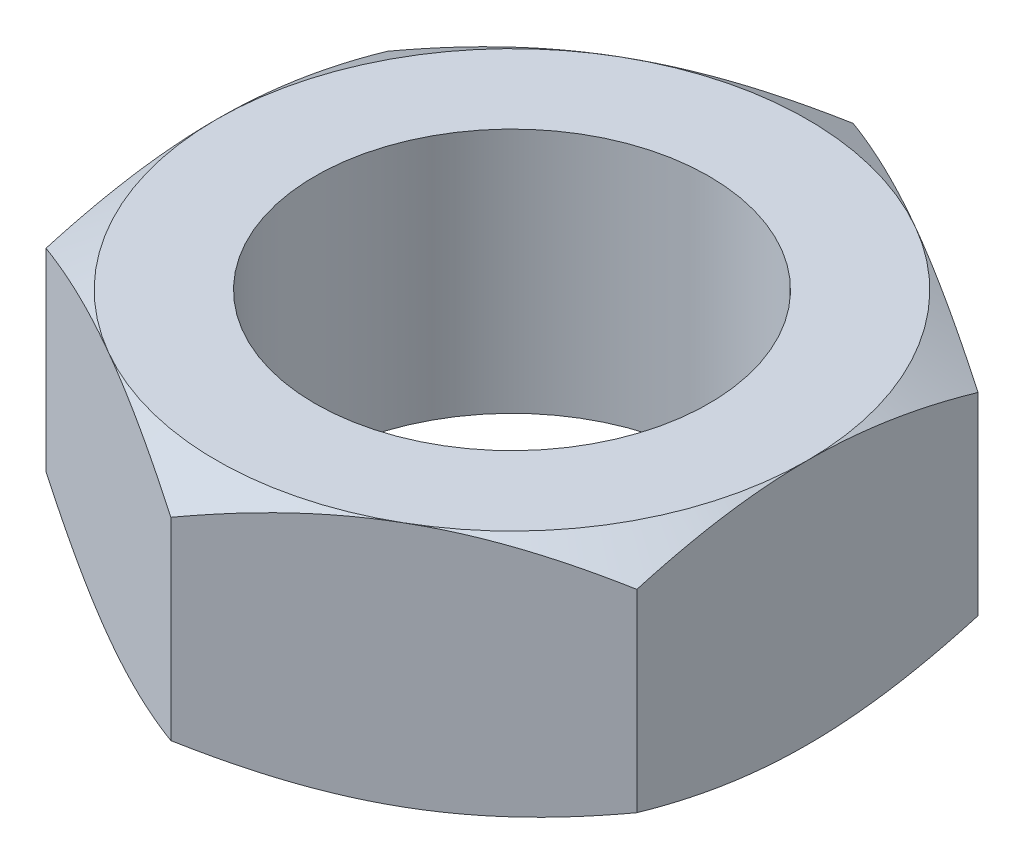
ISO-10303-21;
HEADER;
FILE_DESCRIPTION(('STEP AP214'),'2;1');
FILE_NAME('part.step','',(''),(''),'','','');
FILE_SCHEMA(('AUTOMOTIVE_DESIGN { 1 0 10303 214 1 1 1 1 }'));
ENDSEC;
DATA;
#1=APPLICATION_CONTEXT('core data for automotive mechanical design processes');
#2=APPLICATION_PROTOCOL_DEFINITION('international standard','automotive_design',2000,#1);
#3=PRODUCT_CONTEXT('',#1,'mechanical');
#4=PRODUCT('Part','Part','',(#3));
#5=PRODUCT_RELATED_PRODUCT_CATEGORY('part','',(#4));
#6=PRODUCT_DEFINITION_FORMATION('','',#4);
#7=PRODUCT_DEFINITION_CONTEXT('part definition',#1,'design');
#8=PRODUCT_DEFINITION('design','',#6,#7);
#9=PRODUCT_DEFINITION_SHAPE('','',#8);
#10=(LENGTH_UNIT() NAMED_UNIT(*) SI_UNIT(.MILLI.,.METRE.));
#11=(NAMED_UNIT(*) PLANE_ANGLE_UNIT() SI_UNIT($,.RADIAN.));
#12=(NAMED_UNIT(*) SI_UNIT($,.STERADIAN.) SOLID_ANGLE_UNIT());
#13=UNCERTAINTY_MEASURE_WITH_UNIT(LENGTH_MEASURE(1.E-05),#10,'distance_accuracy_value','');
#14=(GEOMETRIC_REPRESENTATION_CONTEXT(3) GLOBAL_UNCERTAINTY_ASSIGNED_CONTEXT((#13)) GLOBAL_UNIT_ASSIGNED_CONTEXT((#10,
#11,#12)) REPRESENTATION_CONTEXT('',''));
#15=CARTESIAN_POINT('',(0.,0.,0.));
#16=DIRECTION('',(0.,0.,1.));
#17=DIRECTION('',(1.,0.,0.));
#18=AXIS2_PLACEMENT_3D('',#15,#16,#17);
#19=CARTESIAN_POINT('',(-9.525,3.96875,-5.49926131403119));
#20=DIRECTION('',(0.,1.,0.));
#21=DIRECTION('',(0.,0.,1.));
#22=AXIS2_PLACEMENT_3D('',#19,#20,#21);
#23=PLANE('',#22);
#24=CARTESIAN_POINT('',(0.,3.96875,0.));
#25=DIRECTION('',(0.,1.,0.));
#26=DIRECTION('',(0.,0.,1.));
#27=AXIS2_PLACEMENT_3D('',#24,#25,#26);
#28=CIRCLE('',#27,6.35);
#29=CARTESIAN_POINT('',(0.,3.96875,6.35));
#30=VERTEX_POINT('',#29);
#31=EDGE_CURVE('E239',#30,#30,#28,.T.);
#32=ORIENTED_EDGE('',*,*,#31,.F.);
#33=EDGE_LOOP('',(#32));
#34=FACE_BOUND('',#33,.T.);
#35=CARTESIAN_POINT('',(0.,3.96875,0.));
#36=DIRECTION('',(0.,1.,0.));
#37=DIRECTION('',(0.,0.,1.));
#38=AXIS2_PLACEMENT_3D('',#35,#36,#37);
#39=CIRCLE('',#38,9.525);
#40=CARTESIAN_POINT('',(-4.7625,3.96875,8.24889197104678));
#41=VERTEX_POINT('',#40);
#42=CARTESIAN_POINT('',(4.7625,3.96875,8.24889197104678));
#43=VERTEX_POINT('',#42);
#44=EDGE_CURVE('E298',#41,#43,#39,.T.);
#45=ORIENTED_EDGE('',*,*,#44,.T.);
#46=CARTESIAN_POINT('',(9.525,3.96875,0.));
#47=VERTEX_POINT('',#46);
#48=EDGE_CURVE('E301',#43,#47,#39,.T.);
#49=ORIENTED_EDGE('',*,*,#48,.T.);
#50=CARTESIAN_POINT('',(4.7625,3.96875,-8.24889197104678));
#51=VERTEX_POINT('',#50);
#52=EDGE_CURVE('E308',#47,#51,#39,.T.);
#53=ORIENTED_EDGE('',*,*,#52,.T.);
#54=CARTESIAN_POINT('',(-4.7625,3.96875,-8.24889197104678));
#55=VERTEX_POINT('',#54);
#56=EDGE_CURVE('E312',#51,#55,#39,.T.);
#57=ORIENTED_EDGE('',*,*,#56,.T.);
#58=CARTESIAN_POINT('',(-9.525,3.96875,0.));
#59=VERTEX_POINT('',#58);
#60=EDGE_CURVE('E305',#55,#59,#39,.T.);
#61=ORIENTED_EDGE('',*,*,#60,.T.);
#62=EDGE_CURVE('E300',#59,#41,#39,.T.);
#63=ORIENTED_EDGE('',*,*,#62,.T.);
#64=EDGE_LOOP('',(#45,#49,#53,#57,#61,#63));
#65=FACE_BOUND('',#64,.T.);
#66=ADVANCED_FACE('F35',(#34,#65),#23,.T.);
#67=CARTESIAN_POINT('',(0.,3.96875,-10.9985226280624));
#68=DIRECTION('',(0.5,0.,0.866025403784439));
#69=DIRECTION('',(0.866025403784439,0.,-0.5));
#70=AXIS2_PLACEMENT_3D('',#67,#68,#69);
#71=PLANE('',#70);
#72=DIRECTION('',(0.,-1.,0.));
#73=VECTOR('',#72,1.);
#74=CARTESIAN_POINT('',(0.,3.96875,-10.9985226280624));
#75=LINE('',#74,#73);
#76=CARTESIAN_POINT('',(0.,3.11801131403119,-10.9985226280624));
#77=VERTEX_POINT('',#76);
#78=CARTESIAN_POINT('',(0.,-3.11801131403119,-10.9985226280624));
#79=VERTEX_POINT('',#78);
#80=EDGE_CURVE('E236',#77,#79,#75,.T.);
#81=ORIENTED_EDGE('',*,*,#80,.T.);
#82=CARTESIAN_POINT('',(0.000200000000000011,-3.11794464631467,-10.9986380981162));
#83=CARTESIAN_POINT('',(-0.209180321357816,-3.18772679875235,-10.8777523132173));
#84=CARTESIAN_POINT('',(-0.419341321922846,-3.25434176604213,-10.7564158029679));
#85=CARTESIAN_POINT('',(-0.841348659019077,-3.38035853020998,-10.5127697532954));
#86=CARTESIAN_POINT('',(-1.05319552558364,-3.43975795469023,-10.3904599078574));
#87=CARTESIAN_POINT('',(-1.69214962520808,-3.60598339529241,-10.0215595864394));
#88=CARTESIAN_POINT('',(-2.12177921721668,-3.70053167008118,-9.77351282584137));
#89=CARTESIAN_POINT('',(-2.76470023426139,-3.81139837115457,-9.40232220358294));
#90=CARTESIAN_POINT('',(-2.97607088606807,-3.84298013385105,-9.28028730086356));
#91=CARTESIAN_POINT('',(-3.39979082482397,-3.8959407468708,-9.03565248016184));
#92=CARTESIAN_POINT('',(-3.61214013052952,-3.91731940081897,-8.91305255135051));
#93=CARTESIAN_POINT('',(-4.03719295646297,-3.94932602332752,-8.66764818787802));
#94=CARTESIAN_POINT('',(-4.24989575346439,-3.9599667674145,-8.54484417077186));
#95=CARTESIAN_POINT('',(-4.67549782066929,-3.97027146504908,-8.29912270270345));
#96=CARTESIAN_POINT('',(-4.8883970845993,-3.96993575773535,-8.17620525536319));
#97=CARTESIAN_POINT('',(-5.28641747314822,-3.95905115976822,-7.94640807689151));
#98=CARTESIAN_POINT('',(-5.4715666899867,-3.94983005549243,-7.83951212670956));
#99=CARTESIAN_POINT('',(-5.84143209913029,-3.92326519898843,-7.62597023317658));
#100=CARTESIAN_POINT('',(-6.02614825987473,-3.90592087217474,-7.51932430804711));
#101=CARTESIAN_POINT('',(-6.57958100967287,-3.84211312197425,-7.19979976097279));
#102=CARTESIAN_POINT('',(-6.94731798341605,-3.78388287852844,-6.98748672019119));
#103=CARTESIAN_POINT('',(-7.68669273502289,-3.63830670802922,-6.56060850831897));
#104=CARTESIAN_POINT('',(-8.05823615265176,-3.55034370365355,-6.34609781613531));
#105=CARTESIAN_POINT('',(-8.79578238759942,-3.35070420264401,-5.92027529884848));
#106=CARTESIAN_POINT('',(-9.16179464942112,-3.23907459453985,-5.70895802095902));
#107=CARTESIAN_POINT('',(-9.5252,-3.11794464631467,-5.49914584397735));
#108=B_SPLINE_CURVE_WITH_KNOTS('',3,(#82,#83,#84,#85,#86,#87,#88,#89,#90,#91,#92,#93,#94,#95,
#96,#97,#98,#99,#100,#101,#102,#103,#104,#105,#106,#107),.UNSPECIFIED.,.F.,.F.,(4,2,2,2,2,2,2,2,
2,2,2,2,4),(0.,0.754861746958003,1.50997101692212,3.02340406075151,3.76154608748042,
4.49970232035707,5.23697928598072,5.97423347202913,6.61604550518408,7.25790294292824,
8.54252993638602,9.85564695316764,11.1661863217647),.UNSPECIFIED.);
#109=CARTESIAN_POINT('',(-4.7625,-3.96875,-8.24889197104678));
#110=VERTEX_POINT('',#109);
#111=EDGE_CURVE('E58',#79,#110,#108,.T.);
#112=ORIENTED_EDGE('',*,*,#111,.T.);
#113=CARTESIAN_POINT('',(-9.525,-3.11801131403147,-5.49926131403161));
#114=VERTEX_POINT('',#113);
#115=EDGE_CURVE('E194',#110,#114,#108,.T.);
#116=ORIENTED_EDGE('',*,*,#115,.T.);
#117=DIRECTION('',(0.,-1.,0.));
#118=VECTOR('',#117,1.);
#119=CARTESIAN_POINT('',(-9.525,3.96875,-5.49926131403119));
#120=LINE('',#119,#118);
#121=CARTESIAN_POINT('',(-9.525,3.11801131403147,-5.49926131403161));
#122=VERTEX_POINT('',#121);
#123=EDGE_CURVE('E224',#122,#114,#120,.T.);
#124=ORIENTED_EDGE('',*,*,#123,.F.);
#125=CARTESIAN_POINT('',(0.000200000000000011,3.11794464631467,-10.9986380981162));
#126=CARTESIAN_POINT('',(-0.209180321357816,3.18772679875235,-10.8777523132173));
#127=CARTESIAN_POINT('',(-0.419341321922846,3.25434176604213,-10.7564158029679));
#128=CARTESIAN_POINT('',(-0.841348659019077,3.38035853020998,-10.5127697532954));
#129=CARTESIAN_POINT('',(-1.05319552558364,3.43975795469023,-10.3904599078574));
#130=CARTESIAN_POINT('',(-1.69214962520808,3.60598339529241,-10.0215595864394));
#131=CARTESIAN_POINT('',(-2.12177921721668,3.70053167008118,-9.77351282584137));
#132=CARTESIAN_POINT('',(-2.76470023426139,3.81139837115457,-9.40232220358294));
#133=CARTESIAN_POINT('',(-2.97607088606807,3.84298013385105,-9.28028730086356));
#134=CARTESIAN_POINT('',(-3.39979082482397,3.8959407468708,-9.03565248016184));
#135=CARTESIAN_POINT('',(-3.61214013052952,3.91731940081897,-8.91305255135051));
#136=CARTESIAN_POINT('',(-4.03719295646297,3.94932602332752,-8.66764818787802));
#137=CARTESIAN_POINT('',(-4.24989575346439,3.9599667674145,-8.54484417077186));
#138=CARTESIAN_POINT('',(-4.67549782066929,3.97027146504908,-8.29912270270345));
#139=CARTESIAN_POINT('',(-4.8883970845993,3.96993575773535,-8.17620525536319));
#140=CARTESIAN_POINT('',(-5.28641747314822,3.95905115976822,-7.94640807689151));
#141=CARTESIAN_POINT('',(-5.4715666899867,3.94983005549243,-7.83951212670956));
#142=CARTESIAN_POINT('',(-5.84143209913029,3.92326519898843,-7.62597023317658));
#143=CARTESIAN_POINT('',(-6.02614825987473,3.90592087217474,-7.51932430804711));
#144=CARTESIAN_POINT('',(-6.57958100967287,3.84211312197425,-7.19979976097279));
#145=CARTESIAN_POINT('',(-6.94731798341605,3.78388287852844,-6.98748672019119));
#146=CARTESIAN_POINT('',(-7.68669273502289,3.63830670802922,-6.56060850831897));
#147=CARTESIAN_POINT('',(-8.05823615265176,3.55034370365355,-6.34609781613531));
#148=CARTESIAN_POINT('',(-8.79578238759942,3.35070420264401,-5.92027529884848));
#149=CARTESIAN_POINT('',(-9.16179464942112,3.23907459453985,-5.70895802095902));
#150=CARTESIAN_POINT('',(-9.5252,3.11794464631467,-5.49914584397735));
#151=B_SPLINE_CURVE_WITH_KNOTS('',3,(#125,#126,#127,#128,#129,#130,#131,#132,#133,#134,#135,
#136,#137,#138,#139,#140,#141,#142,#143,#144,#145,#146,#147,#148,#149,#150),.UNSPECIFIED.,.F.,
.F.,(4,2,2,2,2,2,2,2,2,2,2,2,4),(0.,0.754861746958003,1.50997101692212,3.02340406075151,
3.76154608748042,4.49970232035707,5.23697928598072,5.97423347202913,6.61604550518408,
7.25790294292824,8.54252993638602,9.85564695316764,11.1661863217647),.UNSPECIFIED.);
#152=EDGE_CURVE('E246',#55,#122,#151,.T.);
#153=ORIENTED_EDGE('',*,*,#152,.F.);
#154=EDGE_CURVE('E243',#77,#55,#151,.T.);
#155=ORIENTED_EDGE('',*,*,#154,.F.);
#156=EDGE_LOOP('',(#81,#112,#116,#124,#153,#155));
#157=FACE_BOUND('',#156,.T.);
#158=ADVANCED_FACE('F37',(#157),#71,.F.);
#159=CARTESIAN_POINT('',(-9.525,3.96875,-5.49926131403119));
#160=DIRECTION('',(1.,0.,0.));
#161=DIRECTION('',(0.,0.,-1.));
#162=AXIS2_PLACEMENT_3D('',#159,#160,#161);
#163=PLANE('',#162);
#164=ORIENTED_EDGE('',*,*,#123,.T.);
#165=CARTESIAN_POINT('',(-9.525,0.793169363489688,-15.0049945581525));
#166=CARTESIAN_POINT('',(-9.525,0.691280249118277,-14.7959596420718));
#167=CARTESIAN_POINT('',(-9.525,0.589881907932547,-14.5866856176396));
#168=CARTESIAN_POINT('',(-9.525,0.388177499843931,-14.1676095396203));
#169=CARTESIAN_POINT('',(-9.525,0.287871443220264,-13.9578074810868));
#170=CARTESIAN_POINT('',(-9.525,-0.0112672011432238,-13.3274817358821));
#171=CARTESIAN_POINT('',(-9.525,-0.208291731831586,-12.9060968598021));
#172=CARTESIAN_POINT('',(-9.525,-0.597382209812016,-12.0584005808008));
#173=CARTESIAN_POINT('',(-9.525,-0.789417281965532,-11.6320749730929));
#174=CARTESIAN_POINT('',(-9.525,-1.16593574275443,-10.7761137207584));
#175=CARTESIAN_POINT('',(-9.525,-1.3504194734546,-10.3464782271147));
#176=CARTESIAN_POINT('',(-9.525,-1.71593512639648,-9.46858416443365));
#177=CARTESIAN_POINT('',(-9.525,-1.8966381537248,-9.02018792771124));
#178=CARTESIAN_POINT('',(-9.525,-2.24492452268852,-8.11823778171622));
#179=CARTESIAN_POINT('',(-9.525,-2.41250642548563,-7.66468331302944));
#180=CARTESIAN_POINT('',(-9.525,-2.73032139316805,-6.75246514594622));
#181=CARTESIAN_POINT('',(-9.525,-2.88058762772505,-6.29381312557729));
#182=CARTESIAN_POINT('',(-9.525,-3.15910636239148,-5.36995029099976));
#183=CARTESIAN_POINT('',(-9.525,-3.28736555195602,-4.90474151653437));
#184=CARTESIAN_POINT('',(-9.525,-3.51518405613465,-3.96999867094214));
#185=CARTESIAN_POINT('',(-9.525,-3.61490414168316,-3.50050484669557));
#186=CARTESIAN_POINT('',(-9.525,-3.73887359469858,-2.79180875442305));
#187=CARTESIAN_POINT('',(-9.525,-3.77592985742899,-2.55481879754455));
#188=CARTESIAN_POINT('',(-9.525,-3.84078503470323,-2.07958330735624));
#189=CARTESIAN_POINT('',(-9.525,-3.86858484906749,-1.84133789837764));
#190=CARTESIAN_POINT('',(-9.525,-3.91401190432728,-1.36712534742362));
#191=CARTESIAN_POINT('',(-9.525,-3.93177158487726,-1.13117094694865));
#192=CARTESIAN_POINT('',(-9.525,-3.95728742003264,-0.65872175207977));
#193=CARTESIAN_POINT('',(-9.525,-3.96504374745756,-0.422226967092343));
#194=CARTESIAN_POINT('',(-9.525,-3.97036680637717,0.0508807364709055));
#195=CARTESIAN_POINT('',(-9.525,-3.96793348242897,0.287493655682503));
#196=CARTESIAN_POINT('',(-9.525,-3.9529392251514,0.760401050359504));
#197=CARTESIAN_POINT('',(-9.525,-3.94037782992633,0.996695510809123));
#198=CARTESIAN_POINT('',(-9.525,-3.89881284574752,1.55756889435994));
#199=CARTESIAN_POINT('',(-9.525,-3.86539444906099,1.88182819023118));
#200=CARTESIAN_POINT('',(-9.525,-3.7812561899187,2.5280765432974));
#201=CARTESIAN_POINT('',(-9.525,-3.73053417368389,2.8500653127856));
#202=CARTESIAN_POINT('',(-9.525,-3.55509123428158,3.81217190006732));
#203=CARTESIAN_POINT('',(-9.525,-3.40712007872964,4.44811375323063));
#204=CARTESIAN_POINT('',(-9.525,-3.14873680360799,5.39953750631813));
#205=CARTESIAN_POINT('',(-9.525,-3.0552542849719,5.71990202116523));
#206=CARTESIAN_POINT('',(-9.525,-2.85813793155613,6.35752355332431));
#207=CARTESIAN_POINT('',(-9.525,-2.75450401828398,6.67478054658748));
#208=CARTESIAN_POINT('',(-9.525,-2.53878414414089,7.30628204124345));
#209=CARTESIAN_POINT('',(-9.525,-2.42670055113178,7.62052735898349));
#210=CARTESIAN_POINT('',(-9.525,-2.19544417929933,8.24638164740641));
#211=CARTESIAN_POINT('',(-9.525,-2.07627156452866,8.55799067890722));
#212=CARTESIAN_POINT('',(-9.525,-1.74562446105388,9.3984607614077));
#213=CARTESIAN_POINT('',(-9.525,-1.52848490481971,9.92509105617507));
#214=CARTESIAN_POINT('',(-9.525,-1.081395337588,10.972905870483));
#215=CARTESIAN_POINT('',(-9.525,-0.851443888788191,11.4940897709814));
#216=CARTESIAN_POINT('',(-9.525,-0.381770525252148,12.5322656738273));
#217=CARTESIAN_POINT('',(-9.525,-0.14204484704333,13.0492559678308));
#218=CARTESIAN_POINT('',(-9.525,0.344832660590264,14.07968974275));
#219=CARTESIAN_POINT('',(-9.525,0.591984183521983,14.5931333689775));
#220=CARTESIAN_POINT('',(-9.525,1.09249791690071,15.6180093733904));
#221=CARTESIAN_POINT('',(-9.525,1.34586954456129,16.1294371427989));
#222=CARTESIAN_POINT('',(-9.525,1.85722972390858,17.1499807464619));
#223=CARTESIAN_POINT('',(-9.525,2.11521831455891,17.6590965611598));
#224=CARTESIAN_POINT('',(-9.525,2.63484526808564,18.6753160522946));
#225=CARTESIAN_POINT('',(-9.525,2.89648280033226,19.1824201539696));
#226=CARTESIAN_POINT('',(-9.525,3.42278001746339,20.1950585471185));
#227=CARTESIAN_POINT('',(-9.525,3.68743971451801,20.7005928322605));
#228=CARTESIAN_POINT('',(-9.525,4.42861830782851,22.1079311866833));
#229=CARTESIAN_POINT('',(-9.525,4.9078544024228,23.0083039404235));
#230=CARTESIAN_POINT('',(-9.525,5.87207394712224,24.8060320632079));
#231=CARTESIAN_POINT('',(-9.525,6.35705775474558,25.7033872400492));
#232=CARTESIAN_POINT('',(-9.525,7.32966322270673,27.492737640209));
#233=CARTESIAN_POINT('',(-9.525,7.8172704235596,28.3847407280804));
#234=CARTESIAN_POINT('',(-9.525,8.55111033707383,29.7213642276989));
#235=CARTESIAN_POINT('',(-9.525,8.7961187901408,30.1666576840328));
#236=CARTESIAN_POINT('',(-9.525,9.28686115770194,31.0568439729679));
#237=CARTESIAN_POINT('',(-9.525,9.53259507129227,31.5017368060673));
#238=CARTESIAN_POINT('',(-9.525,9.77864675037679,31.9464538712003));
#239=B_SPLINE_CURVE_WITH_KNOTS('',3,(#165,#166,#167,#168,#169,#170,#171,#172,#173,#174,#175,
#176,#177,#178,#179,#180,#181,#182,#183,#184,#185,#186,#187,#188,#189,#190,#191,#192,#193,#194,
#195,#196,#197,#198,#199,#200,#201,#202,#203,#204,#205,#206,#207,#208,#209,#210,#211,#212,#213,
#214,#215,#216,#217,#218,#219,#220,#221,#222,#223,#224,#225,#226,#227,#228,#229,#230,#231,#232,
#233,#234,#235,#236,#237,#238),.UNSPECIFIED.,.F.,.F.,(4,2,2,2,2,2,2,2,2,2,2,2,2,2,2,2,2,2,2,2,2,
2,2,2,2,2,2,2,2,2,2,2,2,2,2,2,4),(0.,0.697632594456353,1.39527174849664,2.79074498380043,
4.19342743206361,5.5960462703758,7.04620229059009,8.49651711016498,9.94400584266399,
11.3910538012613,12.8297819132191,13.5492384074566,14.2686249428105,14.9782862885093,
15.687935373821,16.3975883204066,17.1072736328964,18.0846568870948,19.062161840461,
21.0181195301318,22.0192044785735,23.0202971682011,24.0211103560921,25.0219003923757,
26.730564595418,28.4394209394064,30.148941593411,31.8583917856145,33.5706127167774,
35.2828481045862,36.9946998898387,38.7065585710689,41.7664354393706,44.8265036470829,
47.8762273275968,49.4009689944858,50.9257087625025),.UNSPECIFIED.);
#240=CARTESIAN_POINT('',(-9.525,-3.96875,0.));
#241=VERTEX_POINT('',#240);
#242=EDGE_CURVE('E279',#114,#241,#239,.T.);
#243=ORIENTED_EDGE('',*,*,#242,.T.);
#244=CARTESIAN_POINT('',(-9.525,-3.11801131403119,5.49926131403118));
#245=VERTEX_POINT('',#244);
#246=EDGE_CURVE('E273',#241,#245,#239,.T.);
#247=ORIENTED_EDGE('',*,*,#246,.T.);
#248=DIRECTION('',(0.,-1.,0.));
#249=VECTOR('',#248,1.);
#250=CARTESIAN_POINT('',(-9.525,3.96875,5.49926131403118));
#251=LINE('',#250,#249);
#252=CARTESIAN_POINT('',(-9.525,3.11801131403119,5.49926131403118));
#253=VERTEX_POINT('',#252);
#254=EDGE_CURVE('E227',#253,#245,#251,.T.);
#255=ORIENTED_EDGE('',*,*,#254,.F.);
#256=CARTESIAN_POINT('',(-9.525,-0.793169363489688,-15.0049945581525));
#257=CARTESIAN_POINT('',(-9.525,-0.691280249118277,-14.7959596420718));
#258=CARTESIAN_POINT('',(-9.525,-0.589881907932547,-14.5866856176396));
#259=CARTESIAN_POINT('',(-9.525,-0.388177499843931,-14.1676095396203));
#260=CARTESIAN_POINT('',(-9.525,-0.287871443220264,-13.9578074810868));
#261=CARTESIAN_POINT('',(-9.525,0.0112672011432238,-13.3274817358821));
#262=CARTESIAN_POINT('',(-9.525,0.208291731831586,-12.9060968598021));
#263=CARTESIAN_POINT('',(-9.525,0.597382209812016,-12.0584005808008));
#264=CARTESIAN_POINT('',(-9.525,0.789417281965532,-11.6320749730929));
#265=CARTESIAN_POINT('',(-9.525,1.16593574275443,-10.7761137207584));
#266=CARTESIAN_POINT('',(-9.525,1.3504194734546,-10.3464782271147));
#267=CARTESIAN_POINT('',(-9.525,1.71593512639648,-9.46858416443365));
#268=CARTESIAN_POINT('',(-9.525,1.8966381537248,-9.02018792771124));
#269=CARTESIAN_POINT('',(-9.525,2.24492452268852,-8.11823778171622));
#270=CARTESIAN_POINT('',(-9.525,2.41250642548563,-7.66468331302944));
#271=CARTESIAN_POINT('',(-9.525,2.73032139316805,-6.75246514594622));
#272=CARTESIAN_POINT('',(-9.525,2.88058762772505,-6.29381312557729));
#273=CARTESIAN_POINT('',(-9.525,3.15910636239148,-5.36995029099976));
#274=CARTESIAN_POINT('',(-9.525,3.28736555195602,-4.90474151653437));
#275=CARTESIAN_POINT('',(-9.525,3.51518405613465,-3.96999867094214));
#276=CARTESIAN_POINT('',(-9.525,3.61490414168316,-3.50050484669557));
#277=CARTESIAN_POINT('',(-9.525,3.73887359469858,-2.79180875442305));
#278=CARTESIAN_POINT('',(-9.525,3.77592985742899,-2.55481879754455));
#279=CARTESIAN_POINT('',(-9.525,3.84078503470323,-2.07958330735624));
#280=CARTESIAN_POINT('',(-9.525,3.86858484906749,-1.84133789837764));
#281=CARTESIAN_POINT('',(-9.525,3.91401190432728,-1.36712534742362));
#282=CARTESIAN_POINT('',(-9.525,3.93177158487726,-1.13117094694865));
#283=CARTESIAN_POINT('',(-9.525,3.95728742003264,-0.65872175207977));
#284=CARTESIAN_POINT('',(-9.525,3.96504374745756,-0.422226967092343));
#285=CARTESIAN_POINT('',(-9.525,3.97036680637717,0.0508807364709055));
#286=CARTESIAN_POINT('',(-9.525,3.96793348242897,0.287493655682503));
#287=CARTESIAN_POINT('',(-9.525,3.9529392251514,0.760401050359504));
#288=CARTESIAN_POINT('',(-9.525,3.94037782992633,0.996695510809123));
#289=CARTESIAN_POINT('',(-9.525,3.89881284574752,1.55756889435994));
#290=CARTESIAN_POINT('',(-9.525,3.86539444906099,1.88182819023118));
#291=CARTESIAN_POINT('',(-9.525,3.7812561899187,2.5280765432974));
#292=CARTESIAN_POINT('',(-9.525,3.73053417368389,2.8500653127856));
#293=CARTESIAN_POINT('',(-9.525,3.55509123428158,3.81217190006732));
#294=CARTESIAN_POINT('',(-9.525,3.40712007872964,4.44811375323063));
#295=CARTESIAN_POINT('',(-9.525,3.14873680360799,5.39953750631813));
#296=CARTESIAN_POINT('',(-9.525,3.0552542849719,5.71990202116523));
#297=CARTESIAN_POINT('',(-9.525,2.85813793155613,6.35752355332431));
#298=CARTESIAN_POINT('',(-9.525,2.75450401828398,6.67478054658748));
#299=CARTESIAN_POINT('',(-9.525,2.53878414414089,7.30628204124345));
#300=CARTESIAN_POINT('',(-9.525,2.42670055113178,7.62052735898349));
#301=CARTESIAN_POINT('',(-9.525,2.19544417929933,8.24638164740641));
#302=CARTESIAN_POINT('',(-9.525,2.07627156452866,8.55799067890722));
#303=CARTESIAN_POINT('',(-9.525,1.74562446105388,9.3984607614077));
#304=CARTESIAN_POINT('',(-9.525,1.52848490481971,9.92509105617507));
#305=CARTESIAN_POINT('',(-9.525,1.081395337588,10.972905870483));
#306=CARTESIAN_POINT('',(-9.525,0.851443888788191,11.4940897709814));
#307=CARTESIAN_POINT('',(-9.525,0.381770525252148,12.5322656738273));
#308=CARTESIAN_POINT('',(-9.525,0.14204484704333,13.0492559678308));
#309=CARTESIAN_POINT('',(-9.525,-0.344832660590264,14.07968974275));
#310=CARTESIAN_POINT('',(-9.525,-0.591984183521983,14.5931333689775));
#311=CARTESIAN_POINT('',(-9.525,-1.09249791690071,15.6180093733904));
#312=CARTESIAN_POINT('',(-9.525,-1.34586954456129,16.1294371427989));
#313=CARTESIAN_POINT('',(-9.525,-1.85722972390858,17.1499807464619));
#314=CARTESIAN_POINT('',(-9.525,-2.11521831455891,17.6590965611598));
#315=CARTESIAN_POINT('',(-9.525,-2.63484526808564,18.6753160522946));
#316=CARTESIAN_POINT('',(-9.525,-2.89648280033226,19.1824201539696));
#317=CARTESIAN_POINT('',(-9.525,-3.42278001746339,20.1950585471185));
#318=CARTESIAN_POINT('',(-9.525,-3.68743971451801,20.7005928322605));
#319=CARTESIAN_POINT('',(-9.525,-4.42861830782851,22.1079311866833));
#320=CARTESIAN_POINT('',(-9.525,-4.9078544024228,23.0083039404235));
#321=CARTESIAN_POINT('',(-9.525,-5.87207394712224,24.8060320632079));
#322=CARTESIAN_POINT('',(-9.525,-6.35705775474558,25.7033872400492));
#323=CARTESIAN_POINT('',(-9.525,-7.32966322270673,27.492737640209));
#324=CARTESIAN_POINT('',(-9.525,-7.8172704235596,28.3847407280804));
#325=CARTESIAN_POINT('',(-9.525,-8.55111033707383,29.7213642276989));
#326=CARTESIAN_POINT('',(-9.525,-8.7961187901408,30.1666576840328));
#327=CARTESIAN_POINT('',(-9.525,-9.28686115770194,31.0568439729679));
#328=CARTESIAN_POINT('',(-9.525,-9.53259507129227,31.5017368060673));
#329=CARTESIAN_POINT('',(-9.525,-9.77864675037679,31.9464538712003));
#330=B_SPLINE_CURVE_WITH_KNOTS('',3,(#256,#257,#258,#259,#260,#261,#262,#263,#264,#265,#266,
#267,#268,#269,#270,#271,#272,#273,#274,#275,#276,#277,#278,#279,#280,#281,#282,#283,#284,#285,
#286,#287,#288,#289,#290,#291,#292,#293,#294,#295,#296,#297,#298,#299,#300,#301,#302,#303,#304,
#305,#306,#307,#308,#309,#310,#311,#312,#313,#314,#315,#316,#317,#318,#319,#320,#321,#322,#323,
#324,#325,#326,#327,#328,#329),.UNSPECIFIED.,.F.,.F.,(4,2,2,2,2,2,2,2,2,2,2,2,2,2,2,2,2,2,2,2,2,
2,2,2,2,2,2,2,2,2,2,2,2,2,2,2,4),(0.,0.697632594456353,1.39527174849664,2.79074498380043,
4.19342743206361,5.5960462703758,7.04620229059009,8.49651711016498,9.94400584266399,
11.3910538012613,12.8297819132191,13.5492384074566,14.2686249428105,14.9782862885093,
15.687935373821,16.3975883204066,17.1072736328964,18.0846568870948,19.062161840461,
21.0181195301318,22.0192044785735,23.0202971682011,24.0211103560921,25.0219003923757,
26.730564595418,28.4394209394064,30.148941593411,31.8583917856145,33.5706127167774,
35.2828481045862,36.9946998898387,38.7065585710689,41.7664354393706,44.8265036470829,
47.8762273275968,49.4009689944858,50.9257087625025),.UNSPECIFIED.);
#331=EDGE_CURVE('E253',#59,#253,#330,.T.);
#332=ORIENTED_EDGE('',*,*,#331,.F.);
#333=EDGE_CURVE('E252',#122,#59,#330,.T.);
#334=ORIENTED_EDGE('',*,*,#333,.F.);
#335=EDGE_LOOP('',(#164,#243,#247,#255,#332,#334));
#336=FACE_BOUND('',#335,.T.);
#337=ADVANCED_FACE('F266',(#336),#163,.F.);
#338=CARTESIAN_POINT('',(-9.525,3.96875,5.49926131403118));
#339=DIRECTION('',(0.5,0.,-0.866025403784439));
#340=DIRECTION('',(-0.866025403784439,0.,-0.5));
#341=AXIS2_PLACEMENT_3D('',#338,#339,#340);
#342=PLANE('',#341);
#343=ORIENTED_EDGE('',*,*,#254,.T.);
#344=CARTESIAN_POINT('',(-9.5252,-3.11794464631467,5.49914584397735));
#345=CARTESIAN_POINT('',(-9.31581967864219,-3.18772679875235,5.62003162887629));
#346=CARTESIAN_POINT('',(-9.10565867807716,-3.25434176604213,5.74136813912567));
#347=CARTESIAN_POINT('',(-8.68365134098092,-3.38035853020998,5.98501418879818));
#348=CARTESIAN_POINT('',(-8.47180447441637,-3.43975795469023,6.10732403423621));
#349=CARTESIAN_POINT('',(-7.83285037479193,-3.60598339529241,6.47622435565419));
#350=CARTESIAN_POINT('',(-7.40322078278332,-3.70053167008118,6.72427111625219));
#351=CARTESIAN_POINT('',(-6.76029976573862,-3.81139837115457,7.09546173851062));
#352=CARTESIAN_POINT('',(-6.54892911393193,-3.84298013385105,7.21749664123));
#353=CARTESIAN_POINT('',(-6.12520917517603,-3.8959407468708,7.46213146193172));
#354=CARTESIAN_POINT('',(-5.91285986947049,-3.91731940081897,7.58473139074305));
#355=CARTESIAN_POINT('',(-5.48780704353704,-3.94932602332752,7.83013575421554));
#356=CARTESIAN_POINT('',(-5.27510424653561,-3.9599667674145,7.9529397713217));
#357=CARTESIAN_POINT('',(-4.84950217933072,-3.97027146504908,8.1986612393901));
#358=CARTESIAN_POINT('',(-4.63660291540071,-3.96993575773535,8.32157868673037));
#359=CARTESIAN_POINT('',(-4.23858252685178,-3.95905115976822,8.55137586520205));
#360=CARTESIAN_POINT('',(-4.0534333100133,-3.94983005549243,8.658271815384));
#361=CARTESIAN_POINT('',(-3.68356790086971,-3.92326519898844,8.87181370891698));
#362=CARTESIAN_POINT('',(-3.49885174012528,-3.90592087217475,8.97845963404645));
#363=CARTESIAN_POINT('',(-2.94541899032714,-3.84211312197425,9.29798418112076));
#364=CARTESIAN_POINT('',(-2.57768201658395,-3.78388287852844,9.51029722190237));
#365=CARTESIAN_POINT('',(-1.83830726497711,-3.63830670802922,9.93717543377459));
#366=CARTESIAN_POINT('',(-1.46676384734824,-3.55034370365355,10.1516861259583));
#367=CARTESIAN_POINT('',(-0.729217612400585,-3.35070420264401,10.5775086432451));
#368=CARTESIAN_POINT('',(-0.363205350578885,-3.23907459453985,10.7888259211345));
#369=CARTESIAN_POINT('',(0.00020000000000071,-3.11794464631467,10.9986380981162));
#370=B_SPLINE_CURVE_WITH_KNOTS('',3,(#344,#345,#346,#347,#348,#349,#350,#351,#352,#353,#354,
#355,#356,#357,#358,#359,#360,#361,#362,#363,#364,#365,#366,#367,#368,#369),.UNSPECIFIED.,.F.,
.F.,(4,2,2,2,2,2,2,2,2,2,2,2,4),(0.,0.754861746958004,1.50997101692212,3.02340406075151,
3.76154608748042,4.49970232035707,5.23697928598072,5.97423347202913,6.61604550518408,
7.25790294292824,8.54252993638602,9.85564695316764,11.1661863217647),.UNSPECIFIED.);
#371=CARTESIAN_POINT('',(-4.7625,-3.96875,8.24889197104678));
#372=VERTEX_POINT('',#371);
#373=EDGE_CURVE('E159',#245,#372,#370,.T.);
#374=ORIENTED_EDGE('',*,*,#373,.T.);
#375=CARTESIAN_POINT('',(0.,-3.11801131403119,10.9985226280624));
#376=VERTEX_POINT('',#375);
#377=EDGE_CURVE('E143',#372,#376,#370,.T.);
#378=ORIENTED_EDGE('',*,*,#377,.T.);
#379=DIRECTION('',(0.,-1.,0.));
#380=VECTOR('',#379,1.);
#381=CARTESIAN_POINT('',(0.,3.96875,10.9985226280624));
#382=LINE('',#381,#380);
#383=CARTESIAN_POINT('',(0.,3.11801131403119,10.9985226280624));
#384=VERTEX_POINT('',#383);
#385=EDGE_CURVE('E158',#384,#376,#382,.T.);
#386=ORIENTED_EDGE('',*,*,#385,.F.);
#387=CARTESIAN_POINT('',(-9.5252,3.11794464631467,5.49914584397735));
#388=CARTESIAN_POINT('',(-9.31581967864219,3.18772679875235,5.62003162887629));
#389=CARTESIAN_POINT('',(-9.10565867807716,3.25434176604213,5.74136813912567));
#390=CARTESIAN_POINT('',(-8.68365134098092,3.38035853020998,5.98501418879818));
#391=CARTESIAN_POINT('',(-8.47180447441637,3.43975795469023,6.10732403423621));
#392=CARTESIAN_POINT('',(-7.83285037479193,3.60598339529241,6.47622435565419));
#393=CARTESIAN_POINT('',(-7.40322078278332,3.70053167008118,6.72427111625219));
#394=CARTESIAN_POINT('',(-6.76029976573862,3.81139837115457,7.09546173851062));
#395=CARTESIAN_POINT('',(-6.54892911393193,3.84298013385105,7.21749664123));
#396=CARTESIAN_POINT('',(-6.12520917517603,3.8959407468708,7.46213146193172));
#397=CARTESIAN_POINT('',(-5.91285986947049,3.91731940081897,7.58473139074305));
#398=CARTESIAN_POINT('',(-5.48780704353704,3.94932602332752,7.83013575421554));
#399=CARTESIAN_POINT('',(-5.27510424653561,3.9599667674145,7.9529397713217));
#400=CARTESIAN_POINT('',(-4.84950217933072,3.97027146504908,8.1986612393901));
#401=CARTESIAN_POINT('',(-4.63660291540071,3.96993575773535,8.32157868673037));
#402=CARTESIAN_POINT('',(-4.23858252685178,3.95905115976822,8.55137586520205));
#403=CARTESIAN_POINT('',(-4.0534333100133,3.94983005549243,8.658271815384));
#404=CARTESIAN_POINT('',(-3.68356790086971,3.92326519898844,8.87181370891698));
#405=CARTESIAN_POINT('',(-3.49885174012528,3.90592087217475,8.97845963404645));
#406=CARTESIAN_POINT('',(-2.94541899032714,3.84211312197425,9.29798418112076));
#407=CARTESIAN_POINT('',(-2.57768201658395,3.78388287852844,9.51029722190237));
#408=CARTESIAN_POINT('',(-1.83830726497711,3.63830670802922,9.93717543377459));
#409=CARTESIAN_POINT('',(-1.46676384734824,3.55034370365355,10.1516861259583));
#410=CARTESIAN_POINT('',(-0.729217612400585,3.35070420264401,10.5775086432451));
#411=CARTESIAN_POINT('',(-0.363205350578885,3.23907459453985,10.7888259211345));
#412=CARTESIAN_POINT('',(0.00020000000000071,3.11794464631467,10.9986380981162));
#413=B_SPLINE_CURVE_WITH_KNOTS('',3,(#387,#388,#389,#390,#391,#392,#393,#394,#395,#396,#397,
#398,#399,#400,#401,#402,#403,#404,#405,#406,#407,#408,#409,#410,#411,#412),.UNSPECIFIED.,.F.,
.F.,(4,2,2,2,2,2,2,2,2,2,2,2,4),(0.,0.754861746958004,1.50997101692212,3.02340406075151,
3.76154608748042,4.49970232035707,5.23697928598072,5.97423347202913,6.61604550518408,
7.25790294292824,8.54252993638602,9.85564695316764,11.1661863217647),.UNSPECIFIED.);
#414=EDGE_CURVE('E260',#41,#384,#413,.T.);
#415=ORIENTED_EDGE('',*,*,#414,.F.);
#416=EDGE_CURVE('E259',#253,#41,#413,.T.);
#417=ORIENTED_EDGE('',*,*,#416,.F.);
#418=EDGE_LOOP('',(#343,#374,#378,#386,#415,#417));
#419=FACE_BOUND('',#418,.T.);
#420=ADVANCED_FACE('F269',(#419),#342,.F.);
#421=CARTESIAN_POINT('',(0.,3.96875,10.9985226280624));
#422=DIRECTION('',(-0.5,0.,-0.866025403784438));
#423=DIRECTION('',(-0.866025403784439,0.,0.5));
#424=AXIS2_PLACEMENT_3D('',#421,#422,#423);
#425=PLANE('',#424);
#426=ORIENTED_EDGE('',*,*,#385,.T.);
#427=CARTESIAN_POINT('',(-0.000199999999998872,-3.11794464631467,10.9986380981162));
#428=CARTESIAN_POINT('',(0.209180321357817,-3.18772679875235,10.8777523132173));
#429=CARTESIAN_POINT('',(0.419341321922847,-3.25434176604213,10.7564158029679));
#430=CARTESIAN_POINT('',(0.841348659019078,-3.38035853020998,10.5127697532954));
#431=CARTESIAN_POINT('',(1.05319552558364,-3.43975795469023,10.3904599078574));
#432=CARTESIAN_POINT('',(1.69214962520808,-3.60598339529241,10.0215595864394));
#433=CARTESIAN_POINT('',(2.12177921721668,-3.70053167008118,9.77351282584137));
#434=CARTESIAN_POINT('',(2.76470023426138,-3.81139837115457,9.40232220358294));
#435=CARTESIAN_POINT('',(2.97607088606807,-3.84298013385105,9.28028730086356));
#436=CARTESIAN_POINT('',(3.39979082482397,-3.8959407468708,9.03565248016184));
#437=CARTESIAN_POINT('',(3.61214013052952,-3.91731940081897,8.91305255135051));
#438=CARTESIAN_POINT('',(4.03719295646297,-3.94932602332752,8.66764818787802));
#439=CARTESIAN_POINT('',(4.24989575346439,-3.9599667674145,8.54484417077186));
#440=CARTESIAN_POINT('',(4.67549782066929,-3.97027146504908,8.29912270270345));
#441=CARTESIAN_POINT('',(4.8883970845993,-3.96993575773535,8.17620525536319));
#442=CARTESIAN_POINT('',(5.28641747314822,-3.95905115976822,7.94640807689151));
#443=CARTESIAN_POINT('',(5.4715666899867,-3.94983005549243,7.83951212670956));
#444=CARTESIAN_POINT('',(5.84143209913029,-3.92326519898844,7.62597023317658));
#445=CARTESIAN_POINT('',(6.02614825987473,-3.90592087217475,7.5193243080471));
#446=CARTESIAN_POINT('',(6.57958100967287,-3.84211312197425,7.19979976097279));
#447=CARTESIAN_POINT('',(6.94731798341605,-3.78388287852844,6.98748672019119));
#448=CARTESIAN_POINT('',(7.68669273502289,-3.63830670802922,6.56060850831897));
#449=CARTESIAN_POINT('',(8.05823615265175,-3.55034370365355,6.34609781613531));
#450=CARTESIAN_POINT('',(8.79578238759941,-3.35070420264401,5.92027529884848));
#451=CARTESIAN_POINT('',(9.16179464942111,-3.23907459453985,5.70895802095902));
#452=CARTESIAN_POINT('',(9.5252,-3.11794464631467,5.49914584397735));
#453=B_SPLINE_CURVE_WITH_KNOTS('',3,(#427,#428,#429,#430,#431,#432,#433,#434,#435,#436,#437,
#438,#439,#440,#441,#442,#443,#444,#445,#446,#447,#448,#449,#450,#451,#452),.UNSPECIFIED.,.F.,
.F.,(4,2,2,2,2,2,2,2,2,2,2,2,4),(0.,0.754861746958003,1.50997101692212,3.02340406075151,
3.76154608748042,4.49970232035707,5.23697928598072,5.97423347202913,6.61604550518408,
7.25790294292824,8.54252993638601,9.85564695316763,11.1661863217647),.UNSPECIFIED.);
#454=CARTESIAN_POINT('',(4.7625,-3.96875,8.24889197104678));
#455=VERTEX_POINT('',#454);
#456=EDGE_CURVE('E137',#376,#455,#453,.T.);
#457=ORIENTED_EDGE('',*,*,#456,.T.);
#458=CARTESIAN_POINT('',(9.525,-3.11801131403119,5.49926131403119));
#459=VERTEX_POINT('',#458);
#460=EDGE_CURVE('E125',#455,#459,#453,.T.);
#461=ORIENTED_EDGE('',*,*,#460,.T.);
#462=DIRECTION('',(0.,-1.,0.));
#463=VECTOR('',#462,1.);
#464=CARTESIAN_POINT('',(9.525,3.96875,5.49926131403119));
#465=LINE('',#464,#463);
#466=CARTESIAN_POINT('',(9.525,3.11801131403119,5.49926131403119));
#467=VERTEX_POINT('',#466);
#468=EDGE_CURVE('E231',#467,#459,#465,.T.);
#469=ORIENTED_EDGE('',*,*,#468,.F.);
#470=CARTESIAN_POINT('',(-0.000199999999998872,3.11794464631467,10.9986380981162));
#471=CARTESIAN_POINT('',(0.209180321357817,3.18772679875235,10.8777523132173));
#472=CARTESIAN_POINT('',(0.419341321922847,3.25434176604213,10.7564158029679));
#473=CARTESIAN_POINT('',(0.841348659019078,3.38035853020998,10.5127697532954));
#474=CARTESIAN_POINT('',(1.05319552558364,3.43975795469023,10.3904599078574));
#475=CARTESIAN_POINT('',(1.69214962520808,3.60598339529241,10.0215595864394));
#476=CARTESIAN_POINT('',(2.12177921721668,3.70053167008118,9.77351282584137));
#477=CARTESIAN_POINT('',(2.76470023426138,3.81139837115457,9.40232220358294));
#478=CARTESIAN_POINT('',(2.97607088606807,3.84298013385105,9.28028730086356));
#479=CARTESIAN_POINT('',(3.39979082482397,3.8959407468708,9.03565248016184));
#480=CARTESIAN_POINT('',(3.61214013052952,3.91731940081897,8.91305255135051));
#481=CARTESIAN_POINT('',(4.03719295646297,3.94932602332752,8.66764818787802));
#482=CARTESIAN_POINT('',(4.24989575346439,3.9599667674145,8.54484417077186));
#483=CARTESIAN_POINT('',(4.67549782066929,3.97027146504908,8.29912270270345));
#484=CARTESIAN_POINT('',(4.8883970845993,3.96993575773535,8.17620525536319));
#485=CARTESIAN_POINT('',(5.28641747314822,3.95905115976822,7.94640807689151));
#486=CARTESIAN_POINT('',(5.4715666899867,3.94983005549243,7.83951212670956));
#487=CARTESIAN_POINT('',(5.84143209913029,3.92326519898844,7.62597023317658));
#488=CARTESIAN_POINT('',(6.02614825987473,3.90592087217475,7.5193243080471));
#489=CARTESIAN_POINT('',(6.57958100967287,3.84211312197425,7.19979976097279));
#490=CARTESIAN_POINT('',(6.94731798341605,3.78388287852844,6.98748672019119));
#491=CARTESIAN_POINT('',(7.68669273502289,3.63830670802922,6.56060850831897));
#492=CARTESIAN_POINT('',(8.05823615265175,3.55034370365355,6.34609781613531));
#493=CARTESIAN_POINT('',(8.79578238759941,3.35070420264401,5.92027529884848));
#494=CARTESIAN_POINT('',(9.16179464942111,3.23907459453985,5.70895802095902));
#495=CARTESIAN_POINT('',(9.5252,3.11794464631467,5.49914584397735));
#496=B_SPLINE_CURVE_WITH_KNOTS('',3,(#470,#471,#472,#473,#474,#475,#476,#477,#478,#479,#480,
#481,#482,#483,#484,#485,#486,#487,#488,#489,#490,#491,#492,#493,#494,#495),.UNSPECIFIED.,.F.,
.F.,(4,2,2,2,2,2,2,2,2,2,2,2,4),(0.,0.754861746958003,1.50997101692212,3.02340406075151,
3.76154608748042,4.49970232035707,5.23697928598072,5.97423347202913,6.61604550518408,
7.25790294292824,8.54252993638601,9.85564695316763,11.1661863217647),.UNSPECIFIED.);
#497=EDGE_CURVE('E330',#43,#467,#496,.T.);
#498=ORIENTED_EDGE('',*,*,#497,.F.);
#499=EDGE_CURVE('E332',#384,#43,#496,.T.);
#500=ORIENTED_EDGE('',*,*,#499,.F.);
#501=EDGE_LOOP('',(#426,#457,#461,#469,#498,#500));
#502=FACE_BOUND('',#501,.T.);
#503=ADVANCED_FACE('F155',(#502),#425,.F.);
#504=CARTESIAN_POINT('',(9.525,3.96875,5.49926131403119));
#505=DIRECTION('',(-1.,0.,0.));
#506=DIRECTION('',(0.,0.,1.));
#507=AXIS2_PLACEMENT_3D('',#504,#505,#506);
#508=PLANE('',#507);
#509=ORIENTED_EDGE('',*,*,#468,.T.);
#510=CARTESIAN_POINT('',(9.525,0.793169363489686,-15.0049945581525));
#511=CARTESIAN_POINT('',(9.525,0.691280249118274,-14.7959596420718));
#512=CARTESIAN_POINT('',(9.525,0.589881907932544,-14.5866856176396));
#513=CARTESIAN_POINT('',(9.525,0.388177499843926,-14.1676095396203));
#514=CARTESIAN_POINT('',(9.525,0.287871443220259,-13.9578074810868));
#515=CARTESIAN_POINT('',(9.525,-0.0112672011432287,-13.3274817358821));
#516=CARTESIAN_POINT('',(9.525,-0.20829173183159,-12.9060968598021));
#517=CARTESIAN_POINT('',(9.525,-0.597382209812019,-12.0584005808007));
#518=CARTESIAN_POINT('',(9.525,-0.789417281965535,-11.6320749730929));
#519=CARTESIAN_POINT('',(9.525,-1.16593574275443,-10.7761137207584));
#520=CARTESIAN_POINT('',(9.525,-1.3504194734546,-10.3464782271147));
#521=CARTESIAN_POINT('',(9.525,-1.71593512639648,-9.46858416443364));
#522=CARTESIAN_POINT('',(9.525,-1.89663815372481,-9.02018792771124));
#523=CARTESIAN_POINT('',(9.525,-2.24492452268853,-8.11823778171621));
#524=CARTESIAN_POINT('',(9.525,-2.41250642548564,-7.66468331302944));
#525=CARTESIAN_POINT('',(9.525,-2.73032139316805,-6.75246514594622));
#526=CARTESIAN_POINT('',(9.525,-2.88058762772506,-6.29381312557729));
#527=CARTESIAN_POINT('',(9.525,-3.15910636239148,-5.36995029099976));
#528=CARTESIAN_POINT('',(9.525,-3.28736555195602,-4.90474151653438));
#529=CARTESIAN_POINT('',(9.525,-3.51518405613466,-3.96999867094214));
#530=CARTESIAN_POINT('',(9.525,-3.61490414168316,-3.50050484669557));
#531=CARTESIAN_POINT('',(9.525,-3.73887359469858,-2.79180875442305));
#532=CARTESIAN_POINT('',(9.525,-3.77592985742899,-2.55481879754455));
#533=CARTESIAN_POINT('',(9.525,-3.84078503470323,-2.07958330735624));
#534=CARTESIAN_POINT('',(9.525,-3.86858484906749,-1.84133789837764));
#535=CARTESIAN_POINT('',(9.525,-3.91401190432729,-1.36712534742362));
#536=CARTESIAN_POINT('',(9.525,-3.93177158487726,-1.13117094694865));
#537=CARTESIAN_POINT('',(9.525,-3.95728742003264,-0.658721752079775));
#538=CARTESIAN_POINT('',(9.525,-3.96504374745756,-0.422226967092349));
#539=CARTESIAN_POINT('',(9.525,-3.97036680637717,0.0508807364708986));
#540=CARTESIAN_POINT('',(9.525,-3.96793348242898,0.287493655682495));
#541=CARTESIAN_POINT('',(9.525,-3.95293922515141,0.760401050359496));
#542=CARTESIAN_POINT('',(9.525,-3.94037782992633,0.996695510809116));
#543=CARTESIAN_POINT('',(9.525,-3.89881284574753,1.55756889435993));
#544=CARTESIAN_POINT('',(9.525,-3.86539444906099,1.88182819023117));
#545=CARTESIAN_POINT('',(9.525,-3.7812561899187,2.5280765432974));
#546=CARTESIAN_POINT('',(9.525,-3.7305341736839,2.8500653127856));
#547=CARTESIAN_POINT('',(9.525,-3.55509123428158,3.81217190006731));
#548=CARTESIAN_POINT('',(9.525,-3.40712007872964,4.44811375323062));
#549=CARTESIAN_POINT('',(9.525,-3.14873680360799,5.39953750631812));
#550=CARTESIAN_POINT('',(9.525,-3.0552542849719,5.71990202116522));
#551=CARTESIAN_POINT('',(9.525,-2.85813793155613,6.3575235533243));
#552=CARTESIAN_POINT('',(9.525,-2.75450401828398,6.67478054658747));
#553=CARTESIAN_POINT('',(9.525,-2.5387841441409,7.30628204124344));
#554=CARTESIAN_POINT('',(9.525,-2.42670055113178,7.62052735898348));
#555=CARTESIAN_POINT('',(9.525,-2.19544417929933,8.24638164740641));
#556=CARTESIAN_POINT('',(9.525,-2.07627156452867,8.55799067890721));
#557=CARTESIAN_POINT('',(9.525,-1.74562446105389,9.39846076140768));
#558=CARTESIAN_POINT('',(9.525,-1.52848490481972,9.92509105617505));
#559=CARTESIAN_POINT('',(9.525,-1.08139533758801,10.9729058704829));
#560=CARTESIAN_POINT('',(9.525,-0.851443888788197,11.4940897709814));
#561=CARTESIAN_POINT('',(9.525,-0.381770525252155,12.5322656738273));
#562=CARTESIAN_POINT('',(9.525,-0.142044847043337,13.0492559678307));
#563=CARTESIAN_POINT('',(9.525,0.344832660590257,14.07968974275));
#564=CARTESIAN_POINT('',(9.525,0.591984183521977,14.5931333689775));
#565=CARTESIAN_POINT('',(9.525,1.09249791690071,15.6180093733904));
#566=CARTESIAN_POINT('',(9.525,1.34586954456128,16.1294371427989));
#567=CARTESIAN_POINT('',(9.525,1.85722972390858,17.1499807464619));
#568=CARTESIAN_POINT('',(9.525,2.11521831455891,17.6590965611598));
#569=CARTESIAN_POINT('',(9.525,2.63484526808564,18.6753160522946));
#570=CARTESIAN_POINT('',(9.525,2.89648280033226,19.1824201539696));
#571=CARTESIAN_POINT('',(9.525,3.42278001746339,20.1950585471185));
#572=CARTESIAN_POINT('',(9.525,3.68743971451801,20.7005928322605));
#573=CARTESIAN_POINT('',(9.525,4.42861830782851,22.1079311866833));
#574=CARTESIAN_POINT('',(9.525,4.90785440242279,23.0083039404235));
#575=CARTESIAN_POINT('',(9.525,5.87207394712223,24.8060320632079));
#576=CARTESIAN_POINT('',(9.525,6.35705775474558,25.7033872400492));
#577=CARTESIAN_POINT('',(9.525,7.32966322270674,27.492737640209));
#578=CARTESIAN_POINT('',(9.525,7.8172704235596,28.3847407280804));
#579=CARTESIAN_POINT('',(9.525,8.55111033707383,29.7213642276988));
#580=CARTESIAN_POINT('',(9.525,8.79611879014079,30.1666576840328));
#581=CARTESIAN_POINT('',(9.525,9.28686115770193,31.0568439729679));
#582=CARTESIAN_POINT('',(9.525,9.53259507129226,31.5017368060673));
#583=CARTESIAN_POINT('',(9.525,9.77864675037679,31.9464538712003));
#584=B_SPLINE_CURVE_WITH_KNOTS('',3,(#510,#511,#512,#513,#514,#515,#516,#517,#518,#519,#520,
#521,#522,#523,#524,#525,#526,#527,#528,#529,#530,#531,#532,#533,#534,#535,#536,#537,#538,#539,
#540,#541,#542,#543,#544,#545,#546,#547,#548,#549,#550,#551,#552,#553,#554,#555,#556,#557,#558,
#559,#560,#561,#562,#563,#564,#565,#566,#567,#568,#569,#570,#571,#572,#573,#574,#575,#576,#577,
#578,#579,#580,#581,#582,#583),.UNSPECIFIED.,.F.,.F.,(4,2,2,2,2,2,2,2,2,2,2,2,2,2,2,2,2,2,2,2,2,
2,2,2,2,2,2,2,2,2,2,2,2,2,2,2,4),(0.,0.697632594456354,1.39527174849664,2.79074498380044,
4.19342743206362,5.5960462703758,7.04620229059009,8.49651711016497,9.94400584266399,
11.3910538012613,12.8297819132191,13.5492384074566,14.2686249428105,14.9782862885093,
15.687935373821,16.3975883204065,17.1072736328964,18.0846568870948,19.062161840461,
21.0181195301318,22.0192044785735,23.0202971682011,24.0211103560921,25.0219003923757,
26.730564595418,28.4394209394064,30.148941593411,31.8583917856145,33.5706127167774,
35.2828481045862,36.9946998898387,38.7065585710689,41.7664354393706,44.8265036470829,
47.8762273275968,49.4009689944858,50.9257087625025),.UNSPECIFIED.);
#585=CARTESIAN_POINT('',(9.525,-3.96875,0.));
#586=VERTEX_POINT('',#585);
#587=EDGE_CURVE('E132',#459,#586,#584,.F.);
#588=ORIENTED_EDGE('',*,*,#587,.T.);
#589=CARTESIAN_POINT('',(9.525,-3.11801131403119,-5.49926131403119));
#590=VERTEX_POINT('',#589);
#591=EDGE_CURVE('E168',#586,#590,#584,.F.);
#592=ORIENTED_EDGE('',*,*,#591,.T.);
#593=DIRECTION('',(0.,-1.,0.));
#594=VECTOR('',#593,1.);
#595=CARTESIAN_POINT('',(9.525,3.96875,-5.49926131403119));
#596=LINE('',#595,#594);
#597=CARTESIAN_POINT('',(9.525,3.11801131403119,-5.49926131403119));
#598=VERTEX_POINT('',#597);
#599=EDGE_CURVE('E233',#598,#590,#596,.T.);
#600=ORIENTED_EDGE('',*,*,#599,.F.);
#601=CARTESIAN_POINT('',(9.525,-0.793169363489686,-15.0049945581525));
#602=CARTESIAN_POINT('',(9.525,-0.691280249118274,-14.7959596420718));
#603=CARTESIAN_POINT('',(9.525,-0.589881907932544,-14.5866856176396));
#604=CARTESIAN_POINT('',(9.525,-0.388177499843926,-14.1676095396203));
#605=CARTESIAN_POINT('',(9.525,-0.287871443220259,-13.9578074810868));
#606=CARTESIAN_POINT('',(9.525,0.0112672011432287,-13.3274817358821));
#607=CARTESIAN_POINT('',(9.525,0.20829173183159,-12.9060968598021));
#608=CARTESIAN_POINT('',(9.525,0.597382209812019,-12.0584005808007));
#609=CARTESIAN_POINT('',(9.525,0.789417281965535,-11.6320749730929));
#610=CARTESIAN_POINT('',(9.525,1.16593574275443,-10.7761137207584));
#611=CARTESIAN_POINT('',(9.525,1.3504194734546,-10.3464782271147));
#612=CARTESIAN_POINT('',(9.525,1.71593512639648,-9.46858416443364));
#613=CARTESIAN_POINT('',(9.525,1.89663815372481,-9.02018792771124));
#614=CARTESIAN_POINT('',(9.525,2.24492452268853,-8.11823778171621));
#615=CARTESIAN_POINT('',(9.525,2.41250642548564,-7.66468331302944));
#616=CARTESIAN_POINT('',(9.525,2.73032139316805,-6.75246514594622));
#617=CARTESIAN_POINT('',(9.525,2.88058762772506,-6.29381312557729));
#618=CARTESIAN_POINT('',(9.525,3.15910636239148,-5.36995029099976));
#619=CARTESIAN_POINT('',(9.525,3.28736555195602,-4.90474151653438));
#620=CARTESIAN_POINT('',(9.525,3.51518405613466,-3.96999867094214));
#621=CARTESIAN_POINT('',(9.525,3.61490414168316,-3.50050484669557));
#622=CARTESIAN_POINT('',(9.525,3.73887359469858,-2.79180875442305));
#623=CARTESIAN_POINT('',(9.525,3.77592985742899,-2.55481879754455));
#624=CARTESIAN_POINT('',(9.525,3.84078503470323,-2.07958330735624));
#625=CARTESIAN_POINT('',(9.525,3.86858484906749,-1.84133789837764));
#626=CARTESIAN_POINT('',(9.525,3.91401190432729,-1.36712534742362));
#627=CARTESIAN_POINT('',(9.525,3.93177158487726,-1.13117094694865));
#628=CARTESIAN_POINT('',(9.525,3.95728742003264,-0.658721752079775));
#629=CARTESIAN_POINT('',(9.525,3.96504374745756,-0.422226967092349));
#630=CARTESIAN_POINT('',(9.525,3.97036680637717,0.0508807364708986));
#631=CARTESIAN_POINT('',(9.525,3.96793348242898,0.287493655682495));
#632=CARTESIAN_POINT('',(9.525,3.95293922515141,0.760401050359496));
#633=CARTESIAN_POINT('',(9.525,3.94037782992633,0.996695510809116));
#634=CARTESIAN_POINT('',(9.525,3.89881284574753,1.55756889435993));
#635=CARTESIAN_POINT('',(9.525,3.86539444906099,1.88182819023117));
#636=CARTESIAN_POINT('',(9.525,3.7812561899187,2.5280765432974));
#637=CARTESIAN_POINT('',(9.525,3.7305341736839,2.8500653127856));
#638=CARTESIAN_POINT('',(9.525,3.55509123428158,3.81217190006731));
#639=CARTESIAN_POINT('',(9.525,3.40712007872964,4.44811375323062));
#640=CARTESIAN_POINT('',(9.525,3.14873680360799,5.39953750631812));
#641=CARTESIAN_POINT('',(9.525,3.0552542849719,5.71990202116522));
#642=CARTESIAN_POINT('',(9.525,2.85813793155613,6.3575235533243));
#643=CARTESIAN_POINT('',(9.525,2.75450401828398,6.67478054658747));
#644=CARTESIAN_POINT('',(9.525,2.5387841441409,7.30628204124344));
#645=CARTESIAN_POINT('',(9.525,2.42670055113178,7.62052735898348));
#646=CARTESIAN_POINT('',(9.525,2.19544417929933,8.24638164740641));
#647=CARTESIAN_POINT('',(9.525,2.07627156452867,8.55799067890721));
#648=CARTESIAN_POINT('',(9.525,1.74562446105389,9.39846076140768));
#649=CARTESIAN_POINT('',(9.525,1.52848490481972,9.92509105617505));
#650=CARTESIAN_POINT('',(9.525,1.08139533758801,10.9729058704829));
#651=CARTESIAN_POINT('',(9.525,0.851443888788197,11.4940897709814));
#652=CARTESIAN_POINT('',(9.525,0.381770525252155,12.5322656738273));
#653=CARTESIAN_POINT('',(9.525,0.142044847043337,13.0492559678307));
#654=CARTESIAN_POINT('',(9.525,-0.344832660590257,14.07968974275));
#655=CARTESIAN_POINT('',(9.525,-0.591984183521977,14.5931333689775));
#656=CARTESIAN_POINT('',(9.525,-1.09249791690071,15.6180093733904));
#657=CARTESIAN_POINT('',(9.525,-1.34586954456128,16.1294371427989));
#658=CARTESIAN_POINT('',(9.525,-1.85722972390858,17.1499807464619));
#659=CARTESIAN_POINT('',(9.525,-2.11521831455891,17.6590965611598));
#660=CARTESIAN_POINT('',(9.525,-2.63484526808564,18.6753160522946));
#661=CARTESIAN_POINT('',(9.525,-2.89648280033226,19.1824201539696));
#662=CARTESIAN_POINT('',(9.525,-3.42278001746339,20.1950585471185));
#663=CARTESIAN_POINT('',(9.525,-3.68743971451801,20.7005928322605));
#664=CARTESIAN_POINT('',(9.525,-4.42861830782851,22.1079311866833));
#665=CARTESIAN_POINT('',(9.525,-4.90785440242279,23.0083039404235));
#666=CARTESIAN_POINT('',(9.525,-5.87207394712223,24.8060320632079));
#667=CARTESIAN_POINT('',(9.525,-6.35705775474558,25.7033872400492));
#668=CARTESIAN_POINT('',(9.525,-7.32966322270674,27.492737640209));
#669=CARTESIAN_POINT('',(9.525,-7.8172704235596,28.3847407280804));
#670=CARTESIAN_POINT('',(9.525,-8.55111033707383,29.7213642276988));
#671=CARTESIAN_POINT('',(9.525,-8.79611879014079,30.1666576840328));
#672=CARTESIAN_POINT('',(9.525,-9.28686115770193,31.0568439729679));
#673=CARTESIAN_POINT('',(9.525,-9.53259507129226,31.5017368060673));
#674=CARTESIAN_POINT('',(9.525,-9.77864675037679,31.9464538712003));
#675=B_SPLINE_CURVE_WITH_KNOTS('',3,(#601,#602,#603,#604,#605,#606,#607,#608,#609,#610,#611,
#612,#613,#614,#615,#616,#617,#618,#619,#620,#621,#622,#623,#624,#625,#626,#627,#628,#629,#630,
#631,#632,#633,#634,#635,#636,#637,#638,#639,#640,#641,#642,#643,#644,#645,#646,#647,#648,#649,
#650,#651,#652,#653,#654,#655,#656,#657,#658,#659,#660,#661,#662,#663,#664,#665,#666,#667,#668,
#669,#670,#671,#672,#673,#674),.UNSPECIFIED.,.F.,.F.,(4,2,2,2,2,2,2,2,2,2,2,2,2,2,2,2,2,2,2,2,2,
2,2,2,2,2,2,2,2,2,2,2,2,2,2,2,4),(0.,0.697632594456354,1.39527174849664,2.79074498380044,
4.19342743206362,5.5960462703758,7.04620229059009,8.49651711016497,9.94400584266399,
11.3910538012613,12.8297819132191,13.5492384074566,14.2686249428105,14.9782862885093,
15.687935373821,16.3975883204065,17.1072736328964,18.0846568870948,19.062161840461,
21.0181195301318,22.0192044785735,23.0202971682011,24.0211103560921,25.0219003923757,
26.730564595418,28.4394209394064,30.148941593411,31.8583917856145,33.5706127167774,
35.2828481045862,36.9946998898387,38.7065585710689,41.7664354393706,44.8265036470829,
47.8762273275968,49.4009689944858,50.9257087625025),.UNSPECIFIED.);
#676=EDGE_CURVE('E307',#47,#598,#675,.F.);
#677=ORIENTED_EDGE('',*,*,#676,.F.);
#678=EDGE_CURVE('E311',#467,#47,#675,.F.);
#679=ORIENTED_EDGE('',*,*,#678,.F.);
#680=EDGE_LOOP('',(#509,#588,#592,#600,#677,#679));
#681=FACE_BOUND('',#680,.T.);
#682=ADVANCED_FACE('F213',(#681),#508,.F.);
#683=CARTESIAN_POINT('',(9.525,3.96875,-5.49926131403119));
#684=DIRECTION('',(-0.5,0.,0.866025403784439));
#685=DIRECTION('',(0.866025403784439,0.,0.5));
#686=AXIS2_PLACEMENT_3D('',#683,#684,#685);
#687=PLANE('',#686);
#688=ORIENTED_EDGE('',*,*,#599,.T.);
#689=CARTESIAN_POINT('',(9.5252,-3.11794464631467,-5.49914584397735));
#690=CARTESIAN_POINT('',(9.31581967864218,-3.18772679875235,-5.6200316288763));
#691=CARTESIAN_POINT('',(9.10565867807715,-3.25434176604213,-5.74136813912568));
#692=CARTESIAN_POINT('',(8.68365134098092,-3.38035853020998,-5.98501418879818));
#693=CARTESIAN_POINT('',(8.47180447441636,-3.43975795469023,-6.10732403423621));
#694=CARTESIAN_POINT('',(7.83285037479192,-3.60598339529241,-6.4762243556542));
#695=CARTESIAN_POINT('',(7.40322078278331,-3.70053167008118,-6.72427111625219));
#696=CARTESIAN_POINT('',(6.76029976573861,-3.81139837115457,-7.09546173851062));
#697=CARTESIAN_POINT('',(6.54892911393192,-3.84298013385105,-7.21749664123));
#698=CARTESIAN_POINT('',(6.12520917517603,-3.8959407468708,-7.46213146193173));
#699=CARTESIAN_POINT('',(5.91285986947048,-3.91731940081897,-7.58473139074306));
#700=CARTESIAN_POINT('',(5.48780704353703,-3.94932602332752,-7.83013575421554));
#701=CARTESIAN_POINT('',(5.27510424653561,-3.9599667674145,-7.9529397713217));
#702=CARTESIAN_POINT('',(4.84950217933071,-3.97027146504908,-8.19866123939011));
#703=CARTESIAN_POINT('',(4.6366029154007,-3.96993575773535,-8.32157868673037));
#704=CARTESIAN_POINT('',(4.23858252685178,-3.95905115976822,-8.55137586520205));
#705=CARTESIAN_POINT('',(4.0534333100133,-3.94983005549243,-8.658271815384));
#706=CARTESIAN_POINT('',(3.68356790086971,-3.92326519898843,-8.87181370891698));
#707=CARTESIAN_POINT('',(3.49885174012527,-3.90592087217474,-8.97845963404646));
#708=CARTESIAN_POINT('',(2.94541899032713,-3.84211312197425,-9.29798418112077));
#709=CARTESIAN_POINT('',(2.57768201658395,-3.78388287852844,-9.51029722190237));
#710=CARTESIAN_POINT('',(1.83830726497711,-3.63830670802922,-9.93717543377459));
#711=CARTESIAN_POINT('',(1.46676384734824,-3.55034370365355,-10.1516861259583));
#712=CARTESIAN_POINT('',(0.729217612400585,-3.35070420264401,-10.5775086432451));
#713=CARTESIAN_POINT('',(0.363205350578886,-3.23907459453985,-10.7888259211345));
#714=CARTESIAN_POINT('',(-0.000199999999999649,-3.11794464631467,-10.9986380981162));
#715=B_SPLINE_CURVE_WITH_KNOTS('',3,(#689,#690,#691,#692,#693,#694,#695,#696,#697,#698,#699,
#700,#701,#702,#703,#704,#705,#706,#707,#708,#709,#710,#711,#712,#713,#714),.UNSPECIFIED.,.F.,
.F.,(4,2,2,2,2,2,2,2,2,2,2,2,4),(0.,0.754861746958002,1.50997101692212,3.02340406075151,
3.76154608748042,4.49970232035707,5.23697928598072,5.97423347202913,6.61604550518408,
7.25790294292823,8.54252993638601,9.85564695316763,11.1661863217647),.UNSPECIFIED.);
#716=CARTESIAN_POINT('',(4.7625,-3.96875,-8.24889197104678));
#717=VERTEX_POINT('',#716);
#718=EDGE_CURVE('E208',#590,#717,#715,.T.);
#719=ORIENTED_EDGE('',*,*,#718,.T.);
#720=EDGE_CURVE('E152',#717,#79,#715,.T.);
#721=ORIENTED_EDGE('',*,*,#720,.T.);
#722=ORIENTED_EDGE('',*,*,#80,.F.);
#723=CARTESIAN_POINT('',(9.5252,3.11794464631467,-5.49914584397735));
#724=CARTESIAN_POINT('',(9.31581967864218,3.18772679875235,-5.6200316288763));
#725=CARTESIAN_POINT('',(9.10565867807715,3.25434176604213,-5.74136813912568));
#726=CARTESIAN_POINT('',(8.68365134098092,3.38035853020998,-5.98501418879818));
#727=CARTESIAN_POINT('',(8.47180447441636,3.43975795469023,-6.10732403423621));
#728=CARTESIAN_POINT('',(7.83285037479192,3.60598339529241,-6.4762243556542));
#729=CARTESIAN_POINT('',(7.40322078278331,3.70053167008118,-6.72427111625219));
#730=CARTESIAN_POINT('',(6.76029976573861,3.81139837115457,-7.09546173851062));
#731=CARTESIAN_POINT('',(6.54892911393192,3.84298013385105,-7.21749664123));
#732=CARTESIAN_POINT('',(6.12520917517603,3.8959407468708,-7.46213146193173));
#733=CARTESIAN_POINT('',(5.91285986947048,3.91731940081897,-7.58473139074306));
#734=CARTESIAN_POINT('',(5.48780704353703,3.94932602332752,-7.83013575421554));
#735=CARTESIAN_POINT('',(5.27510424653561,3.9599667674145,-7.9529397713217));
#736=CARTESIAN_POINT('',(4.84950217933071,3.97027146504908,-8.19866123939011));
#737=CARTESIAN_POINT('',(4.6366029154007,3.96993575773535,-8.32157868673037));
#738=CARTESIAN_POINT('',(4.23858252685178,3.95905115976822,-8.55137586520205));
#739=CARTESIAN_POINT('',(4.0534333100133,3.94983005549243,-8.658271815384));
#740=CARTESIAN_POINT('',(3.68356790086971,3.92326519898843,-8.87181370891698));
#741=CARTESIAN_POINT('',(3.49885174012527,3.90592087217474,-8.97845963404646));
#742=CARTESIAN_POINT('',(2.94541899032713,3.84211312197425,-9.29798418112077));
#743=CARTESIAN_POINT('',(2.57768201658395,3.78388287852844,-9.51029722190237));
#744=CARTESIAN_POINT('',(1.83830726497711,3.63830670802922,-9.93717543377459));
#745=CARTESIAN_POINT('',(1.46676384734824,3.55034370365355,-10.1516861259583));
#746=CARTESIAN_POINT('',(0.729217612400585,3.35070420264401,-10.5775086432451));
#747=CARTESIAN_POINT('',(0.363205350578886,3.23907459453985,-10.7888259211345));
#748=CARTESIAN_POINT('',(-0.000199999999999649,3.11794464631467,-10.9986380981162));
#749=B_SPLINE_CURVE_WITH_KNOTS('',3,(#723,#724,#725,#726,#727,#728,#729,#730,#731,#732,#733,
#734,#735,#736,#737,#738,#739,#740,#741,#742,#743,#744,#745,#746,#747,#748),.UNSPECIFIED.,.F.,
.F.,(4,2,2,2,2,2,2,2,2,2,2,2,4),(0.,0.754861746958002,1.50997101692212,3.02340406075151,
3.76154608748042,4.49970232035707,5.23697928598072,5.97423347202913,6.61604550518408,
7.25790294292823,8.54252993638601,9.85564695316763,11.1661863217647),.UNSPECIFIED.);
#750=EDGE_CURVE('E218',#51,#77,#749,.T.);
#751=ORIENTED_EDGE('',*,*,#750,.F.);
#752=EDGE_CURVE('E147',#598,#51,#749,.T.);
#753=ORIENTED_EDGE('',*,*,#752,.F.);
#754=EDGE_LOOP('',(#688,#719,#721,#722,#751,#753));
#755=FACE_BOUND('',#754,.T.);
#756=ADVANCED_FACE('F209',(#755),#687,.F.);
#757=CARTESIAN_POINT('',(-9.525,-3.96875,-5.49926131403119));
#758=DIRECTION('',(0.,1.,0.));
#759=DIRECTION('',(0.,0.,1.));
#760=AXIS2_PLACEMENT_3D('',#757,#758,#759);
#761=PLANE('',#760);
#762=CARTESIAN_POINT('',(0.,-3.96875,0.));
#763=DIRECTION('',(0.,1.,0.));
#764=DIRECTION('',(0.,0.,1.));
#765=AXIS2_PLACEMENT_3D('',#762,#763,#764);
#766=CIRCLE('',#765,9.525);
#767=EDGE_CURVE('E40',#455,#372,#766,.F.);
#768=ORIENTED_EDGE('',*,*,#767,.T.);
#769=EDGE_CURVE('E12',#372,#241,#766,.F.);
#770=ORIENTED_EDGE('',*,*,#769,.T.);
#771=EDGE_CURVE('E45',#241,#110,#766,.F.);
#772=ORIENTED_EDGE('',*,*,#771,.T.);
#773=EDGE_CURVE('E289',#110,#717,#766,.F.);
#774=ORIENTED_EDGE('',*,*,#773,.T.);
#775=EDGE_CURVE('E146',#717,#586,#766,.F.);
#776=ORIENTED_EDGE('',*,*,#775,.T.);
#777=CARTESIAN_POINT('',(0.,-3.96875,0.));
#778=DIRECTION('',(0.,1.,0.));
#779=DIRECTION('',(0.,0.,1.));
#780=AXIS2_PLACEMENT_3D('',#777,#778,#779);
#781=CIRCLE('',#780,9.525);
#782=EDGE_CURVE('E129',#455,#586,#781,.T.);
#783=ORIENTED_EDGE('',*,*,#782,.F.);
#784=EDGE_LOOP('',(#768,#770,#772,#774,#776,#783));
#785=FACE_BOUND('',#784,.T.);
#786=CARTESIAN_POINT('',(0.,-3.96875,0.));
#787=DIRECTION('',(0.,1.,0.));
#788=DIRECTION('',(0.,0.,1.));
#789=AXIS2_PLACEMENT_3D('',#786,#787,#788);
#790=CIRCLE('',#789,6.35);
#791=CARTESIAN_POINT('',(0.,-3.96875,6.35));
#792=VERTEX_POINT('',#791);
#793=EDGE_CURVE('E240',#792,#792,#790,.T.);
#794=ORIENTED_EDGE('',*,*,#793,.T.);
#795=EDGE_LOOP('',(#794));
#796=FACE_BOUND('',#795,.T.);
#797=ADVANCED_FACE('F148',(#785,#796),#761,.F.);
#798=CARTESIAN_POINT('',(0.,3.96875,0.));
#799=DIRECTION('',(0.,-1.,0.));
#800=DIRECTION('',(0.,0.,-1.));
#801=AXIS2_PLACEMENT_3D('',#798,#799,#800);
#802=CYLINDRICAL_SURFACE('',#801,6.35);
#803=ORIENTED_EDGE('',*,*,#31,.T.);
#804=EDGE_LOOP('',(#803));
#805=FACE_BOUND('',#804,.T.);
#806=ORIENTED_EDGE('',*,*,#793,.F.);
#807=EDGE_LOOP('',(#806));
#808=FACE_BOUND('',#807,.T.);
#809=ADVANCED_FACE('F346',(#805,#808),#802,.F.);
#810=CARTESIAN_POINT('',(0.,3.96875,0.));
#811=DIRECTION('',(0.,-1.,0.));
#812=DIRECTION('',(0.,0.,1.));
#813=AXIS2_PLACEMENT_3D('',#810,#811,#812);
#814=CONICAL_SURFACE('',#813,9.525,1.0471975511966);
#815=ORIENTED_EDGE('',*,*,#154,.T.);
#816=ORIENTED_EDGE('',*,*,#56,.F.);
#817=ORIENTED_EDGE('',*,*,#750,.T.);
#818=EDGE_LOOP('',(#815,#816,#817));
#819=FACE_BOUND('',#818,.T.);
#820=ADVANCED_FACE('F188',(#819),#814,.T.);
#821=ORIENTED_EDGE('',*,*,#676,.T.);
#822=ORIENTED_EDGE('',*,*,#752,.T.);
#823=ORIENTED_EDGE('',*,*,#52,.F.);
#824=EDGE_LOOP('',(#821,#822,#823));
#825=FACE_BOUND('',#824,.T.);
#826=ADVANCED_FACE('F340',(#825),#814,.T.);
#827=ORIENTED_EDGE('',*,*,#497,.T.);
#828=ORIENTED_EDGE('',*,*,#678,.T.);
#829=ORIENTED_EDGE('',*,*,#48,.F.);
#830=EDGE_LOOP('',(#827,#828,#829));
#831=FACE_BOUND('',#830,.T.);
#832=ADVANCED_FACE('F338',(#831),#814,.T.);
#833=ORIENTED_EDGE('',*,*,#414,.T.);
#834=ORIENTED_EDGE('',*,*,#499,.T.);
#835=ORIENTED_EDGE('',*,*,#44,.F.);
#836=EDGE_LOOP('',(#833,#834,#835));
#837=FACE_BOUND('',#836,.T.);
#838=ADVANCED_FACE('F335',(#837),#814,.T.);
#839=ORIENTED_EDGE('',*,*,#331,.T.);
#840=ORIENTED_EDGE('',*,*,#416,.T.);
#841=ORIENTED_EDGE('',*,*,#62,.F.);
#842=EDGE_LOOP('',(#839,#840,#841));
#843=FACE_BOUND('',#842,.T.);
#844=ADVANCED_FACE('F400',(#843),#814,.T.);
#845=ORIENTED_EDGE('',*,*,#152,.T.);
#846=ORIENTED_EDGE('',*,*,#333,.T.);
#847=ORIENTED_EDGE('',*,*,#60,.F.);
#848=EDGE_LOOP('',(#845,#846,#847));
#849=FACE_BOUND('',#848,.T.);
#850=ADVANCED_FACE('F317',(#849),#814,.T.);
#851=CARTESIAN_POINT('',(0.,-3.96875,0.));
#852=DIRECTION('',(0.,1.,0.));
#853=DIRECTION('',(0.,0.,1.));
#854=AXIS2_PLACEMENT_3D('',#851,#852,#853);
#855=CONICAL_SURFACE('',#854,9.525,1.0471975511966);
#856=ORIENTED_EDGE('',*,*,#767,.F.);
#857=ORIENTED_EDGE('',*,*,#456,.F.);
#858=ORIENTED_EDGE('',*,*,#377,.F.);
#859=EDGE_LOOP('',(#856,#857,#858));
#860=FACE_BOUND('',#859,.T.);
#861=ADVANCED_FACE('F141',(#860),#855,.T.);
#862=ORIENTED_EDGE('',*,*,#782,.T.);
#863=ORIENTED_EDGE('',*,*,#587,.F.);
#864=ORIENTED_EDGE('',*,*,#460,.F.);
#865=EDGE_LOOP('',(#862,#863,#864));
#866=FACE_BOUND('',#865,.T.);
#867=ADVANCED_FACE('F127',(#866),#855,.T.);
#868=ORIENTED_EDGE('',*,*,#775,.F.);
#869=ORIENTED_EDGE('',*,*,#718,.F.);
#870=ORIENTED_EDGE('',*,*,#591,.F.);
#871=EDGE_LOOP('',(#868,#869,#870));
#872=FACE_BOUND('',#871,.T.);
#873=ADVANCED_FACE('F187',(#872),#855,.T.);
#874=ORIENTED_EDGE('',*,*,#720,.F.);
#875=ORIENTED_EDGE('',*,*,#773,.F.);
#876=ORIENTED_EDGE('',*,*,#111,.F.);
#877=EDGE_LOOP('',(#874,#875,#876));
#878=FACE_BOUND('',#877,.T.);
#879=ADVANCED_FACE('F182',(#878),#855,.T.);
#880=ORIENTED_EDGE('',*,*,#771,.F.);
#881=ORIENTED_EDGE('',*,*,#242,.F.);
#882=ORIENTED_EDGE('',*,*,#115,.F.);
#883=EDGE_LOOP('',(#880,#881,#882));
#884=FACE_BOUND('',#883,.T.);
#885=ADVANCED_FACE('F186',(#884),#855,.T.);
#886=ORIENTED_EDGE('',*,*,#769,.F.);
#887=ORIENTED_EDGE('',*,*,#373,.F.);
#888=ORIENTED_EDGE('',*,*,#246,.F.);
#889=EDGE_LOOP('',(#886,#887,#888));
#890=FACE_BOUND('',#889,.T.);
#891=ADVANCED_FACE('F284',(#890),#855,.T.);
#892=CLOSED_SHELL('',(#66,#158,#337,#420,#503,#682,#756,#797,#809,#820,#826,#832,#838,#844,#850,
#861,#867,#873,#879,#885,#891));
#893=MANIFOLD_SOLID_BREP('B2',#892);
#894=ADVANCED_BREP_SHAPE_REPRESENTATION('',(#18,#893),#14);
#895=SHAPE_DEFINITION_REPRESENTATION(#9,#894);
ENDSEC;
END-ISO-10303-21;
